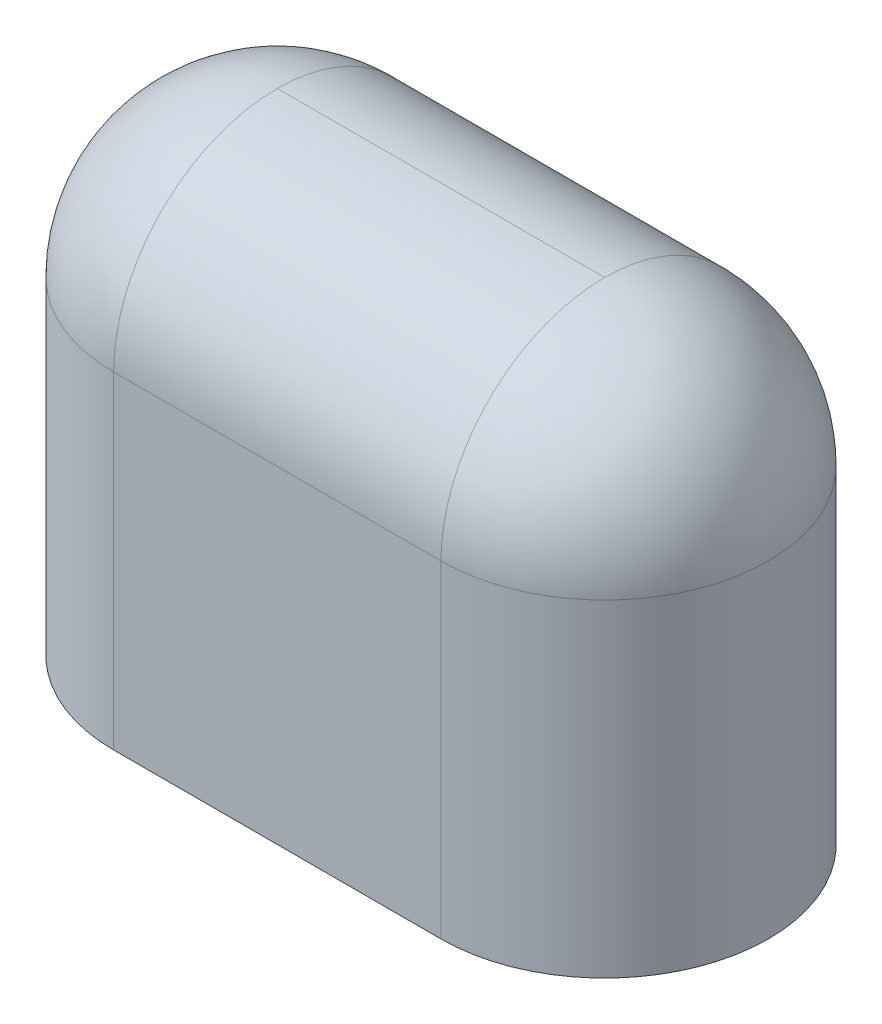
from build123d import *

# Parameters (mm, degrees)
EXTRUDE_1_DEPTH = 9
FILLET_1_R      = 3


with BuildPart() as part:
    # Sketch 1 → Extrude 1 (new body)
    with BuildSketch(Plane(origin=(0, 0, 0), x_dir=(1, 0, 0), z_dir=(0, 1, 0))):
        with BuildLine():
            Line((-3, 3), (3, 3))
            ThreePointArc((3, 3), (6, 0), (3, -3))
            Line((3, -3), (-3, -3))
            ThreePointArc((-3, -3), (-6, 0), (-3, 3))
        make_face()
    extrude(amount=EXTRUDE_1_DEPTH)

    # Fillet 1
    fillet_1_edges = [part.edges().sort_by_distance(p)[0] for p in [
        (6, 9, 0),
        (0, 9, -3),
        (-6, 9, 0),
        (0, 9, 3),
    ]]
    fillet(fillet_1_edges, radius=FILLET_1_R)


solid = part.part
